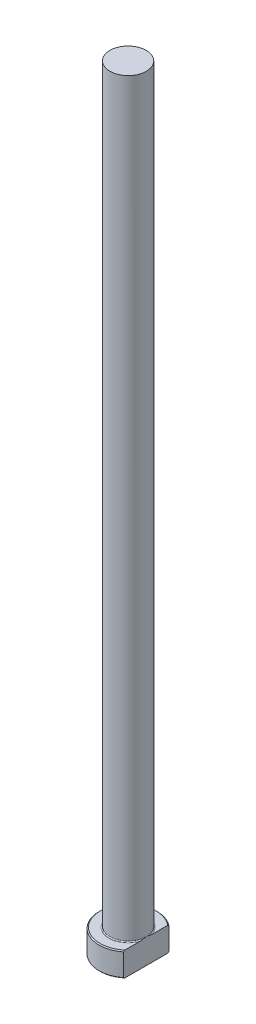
ISO-10303-21;
HEADER;
FILE_DESCRIPTION(('STEP AP214'),'2;1');
FILE_NAME('part.step','',(''),(''),'','','');
FILE_SCHEMA(('AUTOMOTIVE_DESIGN { 1 0 10303 214 1 1 1 1 }'));
ENDSEC;
DATA;
#1=APPLICATION_CONTEXT('core data for automotive mechanical design processes');
#2=APPLICATION_PROTOCOL_DEFINITION('international standard','automotive_design',2000,#1);
#3=PRODUCT_CONTEXT('',#1,'mechanical');
#4=PRODUCT('Part','Part','',(#3));
#5=PRODUCT_RELATED_PRODUCT_CATEGORY('part','',(#4));
#6=PRODUCT_DEFINITION_FORMATION('','',#4);
#7=PRODUCT_DEFINITION_CONTEXT('part definition',#1,'design');
#8=PRODUCT_DEFINITION('design','',#6,#7);
#9=PRODUCT_DEFINITION_SHAPE('','',#8);
#10=(LENGTH_UNIT() NAMED_UNIT(*) SI_UNIT(.MILLI.,.METRE.));
#11=(NAMED_UNIT(*) PLANE_ANGLE_UNIT() SI_UNIT($,.RADIAN.));
#12=(NAMED_UNIT(*) SI_UNIT($,.STERADIAN.) SOLID_ANGLE_UNIT());
#13=UNCERTAINTY_MEASURE_WITH_UNIT(LENGTH_MEASURE(1.E-05),#10,'distance_accuracy_value','');
#14=(GEOMETRIC_REPRESENTATION_CONTEXT(3) GLOBAL_UNCERTAINTY_ASSIGNED_CONTEXT((#13)) GLOBAL_UNIT_ASSIGNED_CONTEXT((#10,
#11,#12)) REPRESENTATION_CONTEXT('',''));
#15=CARTESIAN_POINT('',(0.,0.,0.));
#16=DIRECTION('',(0.,0.,1.));
#17=DIRECTION('',(1.,0.,0.));
#18=AXIS2_PLACEMENT_3D('',#15,#16,#17);
#19=CARTESIAN_POINT('',(0.,0.,0.));
#20=DIRECTION('',(0.,-1.,0.));
#21=DIRECTION('',(0.,0.,-1.));
#22=AXIS2_PLACEMENT_3D('',#19,#20,#21);
#23=PLANE('',#22);
#24=CARTESIAN_POINT('',(0.,0.,0.));
#25=DIRECTION('',(0.,-1.,0.));
#26=DIRECTION('',(0.,0.,-1.));
#27=AXIS2_PLACEMENT_3D('',#24,#25,#26);
#28=CIRCLE('',#27,5.79999999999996);
#29=CARTESIAN_POINT('',(3.74999999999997,0.,4.42464687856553));
#30=VERTEX_POINT('',#29);
#31=CARTESIAN_POINT('',(3.74999999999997,0.,-4.42464687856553));
#32=VERTEX_POINT('',#31);
#33=EDGE_CURVE('E98',#30,#32,#28,.T.);
#34=ORIENTED_EDGE('',*,*,#33,.T.);
#35=DIRECTION('',(0.,0.,1.));
#36=VECTOR('',#35,1.);
#37=CARTESIAN_POINT('',(3.74999999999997,0.,-4.68374849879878));
#38=LINE('',#37,#36);
#39=EDGE_CURVE('E83',#32,#30,#38,.T.);
#40=ORIENTED_EDGE('',*,*,#39,.T.);
#41=EDGE_LOOP('',(#34,#40));
#42=FACE_BOUND('',#41,.T.);
#43=ADVANCED_FACE('F32',(#42),#23,.T.);
#44=CARTESIAN_POINT('',(0.,259.958771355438,0.));
#45=DIRECTION('',(0.,1.,0.));
#46=DIRECTION('',(0.,0.,1.));
#47=AXIS2_PLACEMENT_3D('',#44,#45,#46);
#48=CYLINDRICAL_SURFACE('',#47,5.99999999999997);
#49=CARTESIAN_POINT('',(0.,4.79999999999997,0.));
#50=DIRECTION('',(0.,1.,0.));
#51=DIRECTION('',(0.,0.,1.));
#52=AXIS2_PLACEMENT_3D('',#49,#50,#51);
#53=CIRCLE('',#52,5.99999999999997);
#54=CARTESIAN_POINT('',(3.74999999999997,4.79999999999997,4.68374849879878));
#55=VERTEX_POINT('',#54);
#56=CARTESIAN_POINT('',(3.74999999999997,4.79999999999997,-4.68374849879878));
#57=VERTEX_POINT('',#56);
#58=EDGE_CURVE('E104',#55,#57,#53,.F.);
#59=ORIENTED_EDGE('',*,*,#58,.T.);
#60=DIRECTION('',(0.,-1.,0.));
#61=VECTOR('',#60,1.);
#62=CARTESIAN_POINT('',(3.74999999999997,160.,-4.68374849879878));
#63=LINE('',#62,#61);
#64=CARTESIAN_POINT('',(3.74999999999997,0.199999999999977,-4.68374849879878));
#65=VERTEX_POINT('',#64);
#66=EDGE_CURVE('E183',#57,#65,#63,.T.);
#67=ORIENTED_EDGE('',*,*,#66,.T.);
#68=CARTESIAN_POINT('',(0.,0.199999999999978,0.));
#69=DIRECTION('',(0.,-1.,0.));
#70=DIRECTION('',(0.,0.,-1.));
#71=AXIS2_PLACEMENT_3D('',#68,#69,#70);
#72=CIRCLE('',#71,5.99999999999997);
#73=CARTESIAN_POINT('',(3.74999999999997,0.199999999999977,4.68374849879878));
#74=VERTEX_POINT('',#73);
#75=EDGE_CURVE('E100',#65,#74,#72,.F.);
#76=ORIENTED_EDGE('',*,*,#75,.T.);
#77=DIRECTION('',(0.,-1.,0.));
#78=VECTOR('',#77,1.);
#79=CARTESIAN_POINT('',(3.74999999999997,160.,4.68374849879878));
#80=LINE('',#79,#78);
#81=EDGE_CURVE('E93',#55,#74,#80,.T.);
#82=ORIENTED_EDGE('',*,*,#81,.F.);
#83=EDGE_LOOP('',(#59,#67,#76,#82));
#84=FACE_BOUND('',#83,.T.);
#85=ADVANCED_FACE('F158',(#84),#48,.T.);
#86=CARTESIAN_POINT('',(-5.99999999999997,5.,0.));
#87=DIRECTION('',(0.,1.,0.));
#88=DIRECTION('',(0.,0.,1.));
#89=AXIS2_PLACEMENT_3D('',#86,#87,#88);
#90=PLANE('',#89);
#91=CARTESIAN_POINT('',(0.,5.,0.));
#92=DIRECTION('',(0.,1.,0.));
#93=DIRECTION('',(0.,0.,1.));
#94=AXIS2_PLACEMENT_3D('',#91,#92,#93);
#95=CIRCLE('',#94,5.79999999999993);
#96=CARTESIAN_POINT('',(3.74999999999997,5.,-4.42464687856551));
#97=VERTEX_POINT('',#96);
#98=CARTESIAN_POINT('',(3.74999999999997,5.,4.42464687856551));
#99=VERTEX_POINT('',#98);
#100=EDGE_CURVE('E178',#97,#99,#95,.T.);
#101=ORIENTED_EDGE('',*,*,#100,.T.);
#102=DIRECTION('',(0.,0.,-1.));
#103=VECTOR('',#102,1.);
#104=CARTESIAN_POINT('',(3.74999999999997,5.,0.));
#105=LINE('',#104,#103);
#106=CARTESIAN_POINT('',(3.74999999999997,4.99999999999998,1.24096736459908));
#107=VERTEX_POINT('',#106);
#108=EDGE_CURVE('E57',#99,#107,#105,.T.);
#109=ORIENTED_EDGE('',*,*,#108,.T.);
#110=CARTESIAN_POINT('',(0.,5.,0.));
#111=DIRECTION('',(0.,1.,0.));
#112=DIRECTION('',(0.,0.,1.));
#113=AXIS2_PLACEMENT_3D('',#110,#111,#112);
#114=CIRCLE('',#113,3.94999999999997);
#115=CARTESIAN_POINT('',(3.74999999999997,4.99999999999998,-1.24096736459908));
#116=VERTEX_POINT('',#115);
#117=EDGE_CURVE('E107',#107,#116,#114,.F.);
#118=ORIENTED_EDGE('',*,*,#117,.T.);
#119=EDGE_CURVE('E136',#116,#97,#105,.T.);
#120=ORIENTED_EDGE('',*,*,#119,.T.);
#121=EDGE_LOOP('',(#101,#109,#118,#120));
#122=FACE_BOUND('',#121,.T.);
#123=ADVANCED_FACE('F147',(#122),#90,.T.);
#124=CARTESIAN_POINT('',(0.,5.,0.));
#125=DIRECTION('',(0.,-1.,0.));
#126=DIRECTION('',(0.,0.,-1.));
#127=AXIS2_PLACEMENT_3D('',#124,#125,#126);
#128=CONICAL_SURFACE('',#127,5.79999999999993,0.785398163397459);
#129=ORIENTED_EDGE('',*,*,#58,.F.);
#130=CARTESIAN_POINT('',(3.74999999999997,-0.166791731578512,10.3057275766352));
#131=CARTESIAN_POINT('',(3.74999999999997,-0.0147319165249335,10.1439111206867));
#132=CARTESIAN_POINT('',(3.74999999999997,0.137108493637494,9.98188859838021));
#133=CARTESIAN_POINT('',(3.74999999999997,0.440278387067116,9.65736450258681));
#134=CARTESIAN_POINT('',(3.74999999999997,0.591607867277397,9.49486292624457));
#135=CARTESIAN_POINT('',(3.74999999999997,1.04492777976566,9.00631715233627));
#136=CARTESIAN_POINT('',(3.74999999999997,1.34603930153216,8.67945539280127));
#137=CARTESIAN_POINT('',(3.74999999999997,1.95254712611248,8.01460794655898));
#138=CARTESIAN_POINT('',(3.74999999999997,2.25786252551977,7.67654836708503));
#139=CARTESIAN_POINT('',(3.74999999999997,2.8635361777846,6.99636206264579));
#140=CARTESIAN_POINT('',(3.74999999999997,3.16389732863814,6.65423793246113));
#141=CARTESIAN_POINT('',(3.74999999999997,3.60894976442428,6.13647931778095));
#142=CARTESIAN_POINT('',(3.74999999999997,3.75634976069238,5.96317466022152));
#143=CARTESIAN_POINT('',(3.74999999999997,4.04886653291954,5.61465145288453));
#144=CARTESIAN_POINT('',(3.74999999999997,4.19398335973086,5.43943294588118));
#145=CARTESIAN_POINT('',(3.74999999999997,4.48160030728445,5.0862754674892));
#146=CARTESIAN_POINT('',(3.74999999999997,4.62409465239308,4.90833178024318));
#147=CARTESIAN_POINT('',(3.74999999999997,4.90527650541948,4.54947349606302));
#148=CARTESIAN_POINT('',(3.74999999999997,5.04396432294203,4.36855914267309));
#149=CARTESIAN_POINT('',(3.74999999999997,5.31490367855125,4.0047944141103));
#150=CARTESIAN_POINT('',(3.74999999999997,5.44720614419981,3.821982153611));
#151=CARTESIAN_POINT('',(3.74999999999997,5.70510811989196,3.45154087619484));
#152=CARTESIAN_POINT('',(3.74999999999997,5.83070495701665,3.26390998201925));
#153=CARTESIAN_POINT('',(3.74999999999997,6.07201012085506,2.88323040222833));
#154=CARTESIAN_POINT('',(3.74999999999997,6.18775038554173,2.69020213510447));
#155=CARTESIAN_POINT('',(3.74999999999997,6.40563683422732,2.29668805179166));
#156=CARTESIAN_POINT('',(3.74999999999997,6.50779706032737,2.09621021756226));
#157=CARTESIAN_POINT('',(3.74999999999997,6.65161366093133,1.77679443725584));
#158=CARTESIAN_POINT('',(3.74999999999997,6.70007114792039,1.66092791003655));
#159=CARTESIAN_POINT('',(3.74999999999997,6.78940124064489,1.4262484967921));
#160=CARTESIAN_POINT('',(3.74999999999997,6.83027262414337,1.30743513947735));
#161=CARTESIAN_POINT('',(3.74999999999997,6.90263144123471,1.06768570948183));
#162=CARTESIAN_POINT('',(3.74999999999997,6.93417098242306,0.946765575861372));
#163=CARTESIAN_POINT('',(3.74999999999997,6.98660653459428,0.702615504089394));
#164=CARTESIAN_POINT('',(3.74999999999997,7.00750376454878,0.579385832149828));
#165=CARTESIAN_POINT('',(3.74999999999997,7.03759634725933,0.329742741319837));
#166=CARTESIAN_POINT('',(3.74999999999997,7.04662553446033,0.203308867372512));
#167=CARTESIAN_POINT('',(3.74999999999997,7.05180393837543,-0.0498149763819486));
#168=CARTESIAN_POINT('',(3.74999999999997,7.04795437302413,-0.176504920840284));
#169=CARTESIAN_POINT('',(3.74999999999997,7.02762041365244,-0.429279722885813));
#170=CARTESIAN_POINT('',(3.74999999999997,7.01109328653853,-0.555361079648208));
#171=CARTESIAN_POINT('',(3.74999999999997,6.96645264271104,-0.805449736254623));
#172=CARTESIAN_POINT('',(3.74999999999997,6.93833559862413,-0.929456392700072));
#173=CARTESIAN_POINT('',(3.74999999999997,6.86047960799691,-1.21768075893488));
#174=CARTESIAN_POINT('',(3.74999999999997,6.8066171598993,-1.38077734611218));
#175=CARTESIAN_POINT('',(3.74999999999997,6.68470595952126,-1.70153361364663));
#176=CARTESIAN_POINT('',(3.74999999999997,6.61664932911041,-1.85919021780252));
#177=CARTESIAN_POINT('',(3.74999999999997,6.4690236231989,-2.17116554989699));
#178=CARTESIAN_POINT('',(3.74999999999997,6.38933187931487,-2.32542554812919));
#179=CARTESIAN_POINT('',(3.74999999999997,6.26368569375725,-2.55336011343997));
#180=CARTESIAN_POINT('',(3.74999999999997,6.2207912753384,-2.62875319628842));
#181=CARTESIAN_POINT('',(3.74999999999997,6.13321972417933,-2.77849310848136));
#182=CARTESIAN_POINT('',(3.74999999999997,6.08854268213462,-2.85283999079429));
#183=CARTESIAN_POINT('',(3.74999999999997,5.9312975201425,-3.10843214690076));
#184=CARTESIAN_POINT('',(3.74999999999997,5.81483468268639,-3.2872841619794));
#185=CARTESIAN_POINT('',(3.74999999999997,5.57519396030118,-3.64045104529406));
#186=CARTESIAN_POINT('',(3.74999999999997,5.45201411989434,-3.81476457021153));
#187=CARTESIAN_POINT('',(3.74999999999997,5.2005717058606,-4.15993775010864));
#188=CARTESIAN_POINT('',(3.74999999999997,5.07230420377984,-4.33079380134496));
#189=CARTESIAN_POINT('',(3.74999999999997,4.81202699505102,-4.66958927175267));
#190=CARTESIAN_POINT('',(3.74999999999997,4.6800176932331,-4.83752900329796));
#191=CARTESIAN_POINT('',(3.74999999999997,4.4125358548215,-5.17177751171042));
#192=CARTESIAN_POINT('',(3.74999999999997,4.27705112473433,-5.33807650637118));
#193=CARTESIAN_POINT('',(3.74999999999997,4.00376881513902,-5.66876488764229));
#194=CARTESIAN_POINT('',(3.74999999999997,3.8659711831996,-5.83315423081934));
#195=CARTESIAN_POINT('',(3.74999999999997,3.44998502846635,-6.32380284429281));
#196=CARTESIAN_POINT('',(3.74999999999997,3.16904977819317,-6.64773216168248));
#197=CARTESIAN_POINT('',(3.74999999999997,2.63560043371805,-7.25347079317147));
#198=CARTESIAN_POINT('',(3.74999999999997,2.3836249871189,-7.53575743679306));
#199=CARTESIAN_POINT('',(3.74999999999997,1.87683481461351,-8.09784913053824));
#200=CARTESIAN_POINT('',(3.74999999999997,1.62201964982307,-8.37765378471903));
#201=CARTESIAN_POINT('',(3.74999999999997,1.11240843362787,-8.93303089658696));
#202=CARTESIAN_POINT('',(3.74999999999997,0.857629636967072,-9.20861921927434));
#203=CARTESIAN_POINT('',(3.74999999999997,0.346500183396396,-9.75823398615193));
#204=CARTESIAN_POINT('',(3.74999999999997,0.0901498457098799,-10.0322607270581));
#205=CARTESIAN_POINT('',(3.74999999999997,-0.166791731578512,-10.3057275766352));
#206=B_SPLINE_CURVE_WITH_KNOTS('',3,(#130,#131,#132,#133,#134,#135,#136,#137,#138,#139,#140,
#141,#142,#143,#144,#145,#146,#147,#148,#149,#150,#151,#152,#153,#154,#155,#156,#157,#158,#159,
#160,#161,#162,#163,#164,#165,#166,#167,#168,#169,#170,#171,#172,#173,#174,#175,#176,#177,#178,
#179,#180,#181,#182,#183,#184,#185,#186,#187,#188,#189,#190,#191,#192,#193,#194,#195,#196,#197,
#198,#199,#200,#201,#202,#203,#204,#205),.UNSPECIFIED.,.F.,.F.,(4,2,2,2,2,2,2,2,2,2,2,2,2,2,2,2,
2,2,2,2,2,2,2,2,2,2,2,2,2,2,2,2,2,2,2,2,2,4),(0.,0.666153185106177,1.33231034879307,
2.66554544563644,4.03209014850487,5.39780491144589,6.0803232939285,6.76282645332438,
7.44668645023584,8.13049065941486,8.80737551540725,9.48452819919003,10.1593958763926,
10.8335602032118,11.210125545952,11.586751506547,11.9612329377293,12.3356714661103,
12.7152985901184,13.0948898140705,13.4757662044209,13.8567585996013,14.3711324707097,
14.8857925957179,15.406333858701,15.6665395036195,15.9267319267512,16.5667748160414,
17.207005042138,17.8478713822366,18.4886686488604,19.1321508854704,19.7756477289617,
21.0619101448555,22.1970548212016,23.3323774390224,24.4583149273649,25.5840308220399),.UNSPECIFIED.);
#207=EDGE_CURVE('E135',#55,#99,#206,.T.);
#208=ORIENTED_EDGE('',*,*,#207,.T.);
#209=ORIENTED_EDGE('',*,*,#100,.F.);
#210=EDGE_CURVE('E127',#97,#57,#206,.T.);
#211=ORIENTED_EDGE('',*,*,#210,.T.);
#212=EDGE_LOOP('',(#129,#208,#209,#211));
#213=FACE_BOUND('',#212,.T.);
#214=ADVANCED_FACE('F143',(#213),#128,.T.);
#215=CARTESIAN_POINT('',(0.,0.199999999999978,0.));
#216=DIRECTION('',(0.,1.,0.));
#217=DIRECTION('',(0.,0.,1.));
#218=AXIS2_PLACEMENT_3D('',#215,#216,#217);
#219=CONICAL_SURFACE('',#218,5.99999999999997,0.785398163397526);
#220=ORIENTED_EDGE('',*,*,#75,.F.);
#221=CARTESIAN_POINT('',(3.74999999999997,5.1667917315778,-10.3057275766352));
#222=CARTESIAN_POINT('',(3.74999999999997,5.01473191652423,-10.1439111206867));
#223=CARTESIAN_POINT('',(3.74999999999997,4.86289150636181,-9.98188859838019));
#224=CARTESIAN_POINT('',(3.74999999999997,4.55972161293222,-9.65736450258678));
#225=CARTESIAN_POINT('',(3.74999999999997,4.40839213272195,-9.49486292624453));
#226=CARTESIAN_POINT('',(3.74999999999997,3.95507222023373,-9.00631715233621));
#227=CARTESIAN_POINT('',(3.74999999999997,3.65396069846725,-8.67945539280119));
#228=CARTESIAN_POINT('',(3.74999999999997,3.04745287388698,-8.01460794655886));
#229=CARTESIAN_POINT('',(3.74999999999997,2.74213747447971,-7.67654836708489));
#230=CARTESIAN_POINT('',(3.74999999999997,2.13646382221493,-6.99636206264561));
#231=CARTESIAN_POINT('',(3.74999999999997,1.83610267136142,-6.65423793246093));
#232=CARTESIAN_POINT('',(3.74999999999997,1.39105023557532,-6.13647931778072));
#233=CARTESIAN_POINT('',(3.74999999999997,1.24365023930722,-5.96317466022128));
#234=CARTESIAN_POINT('',(3.74999999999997,0.951133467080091,-5.61465145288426));
#235=CARTESIAN_POINT('',(3.74999999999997,0.806016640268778,-5.4394329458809));
#236=CARTESIAN_POINT('',(3.74999999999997,0.518399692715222,-5.0862754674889));
#237=CARTESIAN_POINT('',(3.74999999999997,0.375905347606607,-4.90833178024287));
#238=CARTESIAN_POINT('',(3.74999999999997,0.0947234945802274,-4.54947349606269));
#239=CARTESIAN_POINT('',(3.74999999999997,-0.0439643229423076,-4.36855914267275));
#240=CARTESIAN_POINT('',(3.74999999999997,-0.314903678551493,-4.00479441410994));
#241=CARTESIAN_POINT('',(3.74999999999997,-0.447206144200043,-3.82198215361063));
#242=CARTESIAN_POINT('',(3.74999999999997,-0.705108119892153,-3.45154087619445));
#243=CARTESIAN_POINT('',(3.74999999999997,-0.830704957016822,-3.26390998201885));
#244=CARTESIAN_POINT('',(3.74999999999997,-1.0720101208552,-2.88323040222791));
#245=CARTESIAN_POINT('',(3.74999999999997,-1.18775038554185,-2.69020213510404));
#246=CARTESIAN_POINT('',(3.74999999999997,-1.40563683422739,-2.29668805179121));
#247=CARTESIAN_POINT('',(3.74999999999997,-1.50779706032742,-2.0962102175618));
#248=CARTESIAN_POINT('',(3.74999999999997,-1.65161366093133,-1.77679443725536));
#249=CARTESIAN_POINT('',(3.74999999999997,-1.70007114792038,-1.66092791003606));
#250=CARTESIAN_POINT('',(3.74999999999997,-1.78940124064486,-1.42624849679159));
#251=CARTESIAN_POINT('',(3.74999999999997,-1.83027262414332,-1.30743513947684));
#252=CARTESIAN_POINT('',(3.74999999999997,-1.90263144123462,-1.06768570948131));
#253=CARTESIAN_POINT('',(3.74999999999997,-1.93417098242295,-0.94676557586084));
#254=CARTESIAN_POINT('',(3.74999999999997,-1.98660653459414,-0.702615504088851));
#255=CARTESIAN_POINT('',(3.74999999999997,-2.00750376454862,-0.579385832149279));
#256=CARTESIAN_POINT('',(3.74999999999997,-2.03759634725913,-0.329742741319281));
#257=CARTESIAN_POINT('',(3.74999999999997,-2.04662553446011,-0.203308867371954));
#258=CARTESIAN_POINT('',(3.74999999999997,-2.05180393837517,0.049814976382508));
#259=CARTESIAN_POINT('',(3.74999999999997,-2.04795437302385,0.176504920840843));
#260=CARTESIAN_POINT('',(3.74999999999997,-2.02762041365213,0.42927972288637));
#261=CARTESIAN_POINT('',(3.74999999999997,-2.0110932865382,0.555361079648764));
#262=CARTESIAN_POINT('',(3.74999999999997,-1.96645264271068,0.805449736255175));
#263=CARTESIAN_POINT('',(3.74999999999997,-1.93833559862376,0.929456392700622));
#264=CARTESIAN_POINT('',(3.74999999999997,-1.8604796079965,1.21768075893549));
#265=CARTESIAN_POINT('',(3.74999999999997,-1.80661715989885,1.38077734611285));
#266=CARTESIAN_POINT('',(3.74999999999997,-1.68470595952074,1.70153361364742));
#267=CARTESIAN_POINT('',(3.74999999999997,-1.61664932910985,1.85919021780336));
#268=CARTESIAN_POINT('',(3.74999999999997,-1.46902362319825,2.17116554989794));
#269=CARTESIAN_POINT('',(3.74999999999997,-1.38933187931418,2.32542554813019));
#270=CARTESIAN_POINT('',(3.74999999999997,-1.26368569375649,2.55336011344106));
#271=CARTESIAN_POINT('',(3.74999999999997,-1.22079127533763,2.62875319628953));
#272=CARTESIAN_POINT('',(3.74999999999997,-1.13321972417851,2.77849310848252));
#273=CARTESIAN_POINT('',(3.74999999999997,-1.08854268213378,2.85283999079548));
#274=CARTESIAN_POINT('',(3.74999999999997,-0.931297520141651,3.10843214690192));
#275=CARTESIAN_POINT('',(3.74999999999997,-0.81483468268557,3.28728416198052));
#276=CARTESIAN_POINT('',(3.74999999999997,-0.575193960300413,3.64045104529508));
#277=CARTESIAN_POINT('',(3.74999999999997,-0.452014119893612,3.81476457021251));
#278=CARTESIAN_POINT('',(3.74999999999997,-0.200571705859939,4.15993775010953));
#279=CARTESIAN_POINT('',(3.74999999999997,-0.0723042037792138,4.3307938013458));
#280=CARTESIAN_POINT('',(3.74999999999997,0.187973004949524,4.66958927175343));
#281=CARTESIAN_POINT('',(3.74999999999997,0.319982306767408,4.83752900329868));
#282=CARTESIAN_POINT('',(3.74999999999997,0.587464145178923,5.17177751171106));
#283=CARTESIAN_POINT('',(3.74999999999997,0.722948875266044,5.33807650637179));
#284=CARTESIAN_POINT('',(3.74999999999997,0.996231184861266,5.66876488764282));
#285=CARTESIAN_POINT('',(3.74999999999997,1.13402881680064,5.83315423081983));
#286=CARTESIAN_POINT('',(3.74999999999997,1.55001497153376,6.32380284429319));
#287=CARTESIAN_POINT('',(3.74999999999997,1.83095022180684,6.6477321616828));
#288=CARTESIAN_POINT('',(3.74999999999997,2.36439956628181,7.2534707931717));
#289=CARTESIAN_POINT('',(3.74999999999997,2.61637501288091,7.53575743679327));
#290=CARTESIAN_POINT('',(3.74999999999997,3.12316518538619,8.0978491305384));
#291=CARTESIAN_POINT('',(3.74999999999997,3.37798035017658,8.37765378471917));
#292=CARTESIAN_POINT('',(3.74999999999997,3.88759156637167,8.93303089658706));
#293=CARTESIAN_POINT('',(3.74999999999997,4.14237036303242,9.20861921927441));
#294=CARTESIAN_POINT('',(3.74999999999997,4.65349981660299,9.75823398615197));
#295=CARTESIAN_POINT('',(3.74999999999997,4.90985015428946,10.0322607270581));
#296=CARTESIAN_POINT('',(3.74999999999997,5.1667917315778,10.3057275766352));
#297=B_SPLINE_CURVE_WITH_KNOTS('',3,(#221,#222,#223,#224,#225,#226,#227,#228,#229,#230,#231,
#232,#233,#234,#235,#236,#237,#238,#239,#240,#241,#242,#243,#244,#245,#246,#247,#248,#249,#250,
#251,#252,#253,#254,#255,#256,#257,#258,#259,#260,#261,#262,#263,#264,#265,#266,#267,#268,#269,
#270,#271,#272,#273,#274,#275,#276,#277,#278,#279,#280,#281,#282,#283,#284,#285,#286,#287,#288,
#289,#290,#291,#292,#293,#294,#295,#296),.UNSPECIFIED.,.F.,.F.,(4,2,2,2,2,2,2,2,2,2,2,2,2,2,2,2,
2,2,2,2,2,2,2,2,2,2,2,2,2,2,2,2,2,2,2,2,2,4),(0.,0.666153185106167,1.33231034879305,
2.66554544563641,4.03209014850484,5.39780491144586,6.08032329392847,6.76282645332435,
7.4466864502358,8.13049065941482,8.80737551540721,9.48452819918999,10.1593958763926,
10.8335602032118,11.210125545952,11.5867515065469,11.9612329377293,12.3356714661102,
12.7152985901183,13.0948898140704,13.4757662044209,13.8567585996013,14.3711324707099,
14.8857925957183,15.4063338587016,15.6665395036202,15.926731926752,16.566774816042,
17.2070050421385,17.8478713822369,18.4886686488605,19.1321508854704,19.7756477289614,
21.061910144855,22.1970548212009,23.3323774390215,24.4583149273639,25.5840308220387),.UNSPECIFIED.);
#298=EDGE_CURVE('E86',#65,#32,#297,.T.);
#299=ORIENTED_EDGE('',*,*,#298,.T.);
#300=ORIENTED_EDGE('',*,*,#33,.F.);
#301=EDGE_CURVE('E89',#30,#74,#297,.T.);
#302=ORIENTED_EDGE('',*,*,#301,.T.);
#303=EDGE_LOOP('',(#220,#299,#300,#302));
#304=FACE_BOUND('',#303,.T.);
#305=ADVANCED_FACE('F97',(#304),#219,.T.);
#306=CARTESIAN_POINT('',(0.,5.19999999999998,0.));
#307=DIRECTION('',(0.,1.,0.));
#308=DIRECTION('',(0.,0.,1.));
#309=AXIS2_PLACEMENT_3D('',#306,#307,#308);
#310=TOROIDAL_SURFACE('',#309,3.94999999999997,0.2);
#311=CARTESIAN_POINT('',(3.74999999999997,5.19999999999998,0.));
#312=CARTESIAN_POINT('',(3.74999999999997,5.20000051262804,-2.87877875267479E-10));
#313=CARTESIAN_POINT('',(3.74999999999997,5.2000010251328,-2.25357307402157E-07));
#314=CARTESIAN_POINT('',(3.74999999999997,5.20000197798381,-8.32474472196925E-07));
#315=CARTESIAN_POINT('',(3.74999999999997,5.20000240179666,-1.23037624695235E-06));
#316=CARTESIAN_POINT('',(3.74999999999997,5.20000329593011,-2.1874363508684E-06));
#317=CARTESIAN_POINT('',(3.74999999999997,5.20000375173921,-2.76211833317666E-06));
#318=CARTESIAN_POINT('',(3.74999999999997,5.20000455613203,-3.94274255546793E-06));
#319=CARTESIAN_POINT('',(3.74999999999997,5.20000490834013,-4.54644341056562E-06));
#320=CARTESIAN_POINT('',(3.74999999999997,5.20000624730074,-6.92466681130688E-06));
#321=CARTESIAN_POINT('',(3.74999999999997,5.20000716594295,-8.74076191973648E-06));
#322=CARTESIAN_POINT('',(3.74999999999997,5.20000864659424,-1.2305250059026E-05));
#323=CARTESIAN_POINT('',(3.74999999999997,5.20000923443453,-1.4043310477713E-05));
#324=CARTESIAN_POINT('',(3.74999999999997,5.20001175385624,-2.15092611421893E-05));
#325=CARTESIAN_POINT('',(3.74999999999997,5.20001367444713,-2.72432101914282E-05));
#326=CARTESIAN_POINT('',(3.74999999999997,5.20001644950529,-3.79951292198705E-05));
#327=CARTESIAN_POINT('',(3.74999999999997,5.20001742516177,-4.29814178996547E-05));
#328=CARTESIAN_POINT('',(3.74999999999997,5.20002460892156,-8.03310024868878E-05));
#329=CARTESIAN_POINT('',(3.74999999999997,5.20003015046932,-0.000112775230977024));
#330=CARTESIAN_POINT('',(3.74999999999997,5.20005437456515,-0.000241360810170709));
#331=CARTESIAN_POINT('',(3.74999999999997,5.20007738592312,-0.000336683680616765));
#332=CARTESIAN_POINT('',(3.74999999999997,5.2001672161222,-0.000714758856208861));
#333=CARTESIAN_POINT('',(3.74999999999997,5.20023131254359,-0.000997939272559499));
#334=CARTESIAN_POINT('',(3.74999999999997,5.20048834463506,-0.00212553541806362));
#335=CARTESIAN_POINT('',(3.74999999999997,5.20068473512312,-0.00296938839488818));
#336=CARTESIAN_POINT('',(3.74999999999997,5.20150889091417,-0.00651948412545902));
#337=CARTESIAN_POINT('',(3.74999999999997,5.20213227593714,-0.00922644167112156));
#338=CARTESIAN_POINT('',(3.74999999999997,5.21093696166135,-0.047449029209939));
#339=CARTESIAN_POINT('',(3.74999999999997,5.21914648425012,-0.0829604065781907));
#340=CARTESIAN_POINT('',(3.74999999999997,5.23634325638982,-0.157927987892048));
#341=CARTESIAN_POINT('',(3.74999999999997,5.24531641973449,-0.197387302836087));
#342=CARTESIAN_POINT('',(3.74999999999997,5.26041433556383,-0.264774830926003));
#343=CARTESIAN_POINT('',(3.74999999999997,5.26660221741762,-0.292688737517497));
#344=CARTESIAN_POINT('',(3.74999999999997,5.27863779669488,-0.347814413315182));
#345=CARTESIAN_POINT('',(3.74999999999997,5.28449016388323,-0.375025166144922));
#346=CARTESIAN_POINT('',(3.74999999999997,5.30189789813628,-0.457537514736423));
#347=CARTESIAN_POINT('',(3.74999999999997,5.31311990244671,-0.512910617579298));
#348=CARTESIAN_POINT('',(3.74999999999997,5.33435371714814,-0.624416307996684));
#349=CARTESIAN_POINT('',(3.74999999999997,5.34435351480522,-0.68055120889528));
#350=CARTESIAN_POINT('',(3.74999999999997,5.3633402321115,-0.798309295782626));
#351=CARTESIAN_POINT('',(3.74999999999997,5.37214919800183,-0.859962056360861));
#352=CARTESIAN_POINT('',(3.74999999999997,5.38667037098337,-0.983470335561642));
#353=CARTESIAN_POINT('',(3.74999999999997,5.39239104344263,-1.04532482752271));
#354=CARTESIAN_POINT('',(3.74999999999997,5.39944323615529,-1.16735704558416));
#355=CARTESIAN_POINT('',(3.74999999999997,5.40090877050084,-1.22752541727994));
#356=CARTESIAN_POINT('',(3.74999999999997,5.39872274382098,-1.31720401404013));
#357=CARTESIAN_POINT('',(3.74999999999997,5.39729193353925,-1.34676575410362));
#358=CARTESIAN_POINT('',(3.74999999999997,5.39265012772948,-1.40574048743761));
#359=CARTESIAN_POINT('',(3.74999999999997,5.38944021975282,-1.43515356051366));
#360=CARTESIAN_POINT('',(3.74999999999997,5.38068094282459,-1.49396538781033));
#361=CARTESIAN_POINT('',(3.74999999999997,5.37510711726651,-1.52336068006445));
#362=CARTESIAN_POINT('',(3.74999999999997,5.36076919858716,-1.58137061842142));
#363=CARTESIAN_POINT('',(3.74999999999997,5.35200919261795,-1.60998621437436));
#364=CARTESIAN_POINT('',(3.74999999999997,5.33238965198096,-1.65861686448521));
#365=CARTESIAN_POINT('',(3.74999999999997,5.32257316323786,-1.67901898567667));
#366=CARTESIAN_POINT('',(3.74999999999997,5.30467241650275,-1.70783277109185));
#367=CARTESIAN_POINT('',(3.74999999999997,5.29812945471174,-1.71718739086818));
#368=CARTESIAN_POINT('',(3.74999999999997,5.2837001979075,-1.73480018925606));
#369=CARTESIAN_POINT('',(3.74999999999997,5.27581911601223,-1.74306240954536));
#370=CARTESIAN_POINT('',(3.74999999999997,5.26261463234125,-1.75418373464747));
#371=CARTESIAN_POINT('',(3.74999999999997,5.25787681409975,-1.75773399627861));
#372=CARTESIAN_POINT('',(3.74999999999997,5.24794673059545,-1.76414289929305));
#373=CARTESIAN_POINT('',(3.74999999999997,5.24275459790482,-1.76700174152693));
#374=CARTESIAN_POINT('',(3.74999999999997,5.23188845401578,-1.77184194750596));
#375=CARTESIAN_POINT('',(3.74999999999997,5.22620925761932,-1.77381196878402));
#376=CARTESIAN_POINT('',(3.74999999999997,5.21457526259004,-1.77659633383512));
#377=CARTESIAN_POINT('',(3.74999999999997,5.20862098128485,-1.77741276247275));
#378=CARTESIAN_POINT('',(3.74999999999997,5.19743537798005,-1.77775957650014));
#379=CARTESIAN_POINT('',(3.74999999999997,5.19220837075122,-1.77744024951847));
#380=CARTESIAN_POINT('',(3.74999999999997,5.18189414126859,-1.7758778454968));
#381=CARTESIAN_POINT('',(3.74999999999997,5.17680701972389,-1.77463412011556));
#382=CARTESIAN_POINT('',(3.74999999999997,5.16595570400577,-1.7710259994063));
#383=CARTESIAN_POINT('',(3.74999999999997,5.16024847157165,-1.76849257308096));
#384=CARTESIAN_POINT('',(3.74999999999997,5.14931958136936,-1.76253978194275));
#385=CARTESIAN_POINT('',(3.74999999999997,5.14409879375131,-1.75911886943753));
#386=CARTESIAN_POINT('',(3.74999999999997,5.13137207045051,-1.74952862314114));
#387=CARTESIAN_POINT('',(3.74999999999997,5.12422146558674,-1.74289229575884));
#388=CARTESIAN_POINT('',(3.74999999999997,5.11098063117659,-1.72864029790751));
#389=CARTESIAN_POINT('',(3.74999999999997,5.1048935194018,-1.72102185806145));
#390=CARTESIAN_POINT('',(3.74999999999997,5.08827617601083,-1.69771313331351));
#391=CARTESIAN_POINT('',(3.74999999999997,5.07895354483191,-1.68117193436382));
#392=CARTESIAN_POINT('',(3.74999999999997,5.06261247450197,-1.64704828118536));
#393=CARTESIAN_POINT('',(3.74999999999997,5.05559655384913,-1.62946471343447));
#394=CARTESIAN_POINT('',(3.74999999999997,5.04053076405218,-1.58583200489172));
#395=CARTESIAN_POINT('',(3.74999999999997,5.03339137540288,-1.55947193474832));
#396=CARTESIAN_POINT('',(3.74999999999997,5.02157296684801,-1.50618793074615));
#397=CARTESIAN_POINT('',(3.74999999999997,5.01689927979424,-1.47926290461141));
#398=CARTESIAN_POINT('',(3.74999999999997,5.00936793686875,-1.42466530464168));
#399=CARTESIAN_POINT('',(3.74999999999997,5.00654501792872,-1.39698806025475));
#400=CARTESIAN_POINT('',(3.74999999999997,5.00244752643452,-1.34156614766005));
#401=CARTESIAN_POINT('',(3.74999999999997,5.00117081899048,-1.31382162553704));
#402=CARTESIAN_POINT('',(3.74999999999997,4.99934872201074,-1.2362264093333));
#403=CARTESIAN_POINT('',(3.74999999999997,5.00019255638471,-1.18634383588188));
#404=CARTESIAN_POINT('',(3.74999999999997,5.00481837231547,-1.08670490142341));
#405=CARTESIAN_POINT('',(3.74999999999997,5.00860250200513,-1.03694865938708));
#406=CARTESIAN_POINT('',(3.74999999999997,5.02331363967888,-0.887521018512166));
#407=CARTESIAN_POINT('',(3.74999999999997,5.03759480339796,-0.788187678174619));
#408=CARTESIAN_POINT('',(3.74999999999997,5.06960041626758,-0.600482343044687));
#409=CARTESIAN_POINT('',(3.74999999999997,5.08683046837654,-0.512017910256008));
#410=CARTESIAN_POINT('',(3.74999999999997,5.12342991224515,-0.336669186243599));
#411=CARTESIAN_POINT('',(3.74999999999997,5.14277046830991,-0.249778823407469));
#412=CARTESIAN_POINT('',(3.74999999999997,5.16735885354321,-0.141807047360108));
#413=CARTESIAN_POINT('',(3.74999999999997,5.17220802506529,-0.120630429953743));
#414=CARTESIAN_POINT('',(3.74999999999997,5.18059064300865,-0.0841346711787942));
#415=CARTESIAN_POINT('',(3.74999999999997,5.1841173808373,-0.0688139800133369));
#416=CARTESIAN_POINT('',(3.74999999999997,5.1908487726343,-0.0396407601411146));
#417=CARTESIAN_POINT('',(3.74999999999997,5.19405197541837,-0.0257879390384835));
#418=CARTESIAN_POINT('',(3.74999999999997,5.1978642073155,-0.00924234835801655));
#419=CARTESIAN_POINT('',(3.74999999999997,5.19848382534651,-0.00655125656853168));
#420=CARTESIAN_POINT('',(3.74999999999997,5.19930710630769,-0.00300474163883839));
#421=CARTESIAN_POINT('',(3.74999999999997,5.19950636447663,-0.00214860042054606));
#422=CARTESIAN_POINT('',(3.74999999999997,5.19976688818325,-0.00100569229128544));
#423=CARTESIAN_POINT('',(3.74999999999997,5.19983166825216,-0.000719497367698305));
#424=CARTESIAN_POINT('',(3.74999999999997,5.19992231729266,-0.000337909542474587));
#425=CARTESIAN_POINT('',(3.74999999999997,5.19994544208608,-0.000242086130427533));
#426=CARTESIAN_POINT('',(3.74999999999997,5.1999697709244,-0.00011292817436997));
#427=CARTESIAN_POINT('',(3.74999999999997,5.19997532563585,-8.04160223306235E-05));
#428=CARTESIAN_POINT('',(3.74999999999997,5.19998253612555,-4.29967852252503E-05));
#429=CARTESIAN_POINT('',(3.74999999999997,5.19998351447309,-3.80069370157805E-05));
#430=CARTESIAN_POINT('',(3.74999999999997,5.19998629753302,-2.72475249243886E-05));
#431=CARTESIAN_POINT('',(3.74999999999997,5.19998822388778,-2.15098292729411E-05));
#432=CARTESIAN_POINT('',(3.74999999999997,5.19999075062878,-1.40399367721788E-05));
#433=CARTESIAN_POINT('',(3.74999999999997,5.19999133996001,-1.23016119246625E-05));
#434=CARTESIAN_POINT('',(3.74999999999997,5.19999282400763,-8.73682092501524E-06));
#435=CARTESIAN_POINT('',(3.74999999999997,5.19999374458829,-6.92072367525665E-06));
#436=CARTESIAN_POINT('',(3.74999999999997,5.19999508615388,-4.54275759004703E-06));
#437=CARTESIAN_POINT('',(3.74999999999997,5.19999543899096,-3.93920665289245E-06));
#438=CARTESIAN_POINT('',(3.74999999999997,5.19999624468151,-2.7589957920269E-06));
#439=CARTESIAN_POINT('',(3.74999999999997,5.19999670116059,-2.18458256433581E-06));
#440=CARTESIAN_POINT('',(3.74999999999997,5.19999759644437,-1.22814421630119E-06));
#441=CARTESIAN_POINT('',(3.74999999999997,5.19999802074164,-8.30569674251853E-07));
#442=CARTESIAN_POINT('',(3.74999999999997,5.19999897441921,-2.24293963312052E-07));
#443=CARTESIAN_POINT('',(3.74999999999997,5.19999948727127,2.87934400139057E-10));
#444=CARTESIAN_POINT('',(3.74999999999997,5.19999999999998,0.));
#445=B_SPLINE_CURVE_WITH_KNOTS('',3,(#311,#312,#313,#314,#315,#316,#317,#318,#319,#320,#321,
#322,#323,#324,#325,#326,#327,#328,#329,#330,#331,#332,#333,#334,#335,#336,#337,#338,#339,#340,
#341,#342,#343,#344,#345,#346,#347,#348,#349,#350,#351,#352,#353,#354,#355,#356,#357,#358,#359,
#360,#361,#362,#363,#364,#365,#366,#367,#368,#369,#370,#371,#372,#373,#374,#375,#376,#377,#378,
#379,#380,#381,#382,#383,#384,#385,#386,#387,#388,#389,#390,#391,#392,#393,#394,#395,#396,#397,
#398,#399,#400,#401,#402,#403,#404,#405,#406,#407,#408,#409,#410,#411,#412,#413,#414,#415,#416,
#417,#418,#419,#420,#421,#422,#423,#424,#425,#426,#427,#428,#429,#430,#431,#432,#433,#434,#435,
#436,#437,#438,#439,#440,#441,#442,#443,#444),.UNSPECIFIED.,.T.,.F.,(4,2,2,2,2,2,2,2,2,2,2,2,2,
2,2,2,2,2,2,2,2,2,2,2,2,2,2,2,2,2,2,2,2,2,2,2,2,2,2,2,2,2,2,2,2,2,2,2,2,2,2,2,2,2,2,2,2,2,2,2,2,
2,2,2,2,2,4),(0.,1.56024700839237E-06,3.31164948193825E-06,5.49717735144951E-06,
7.59327506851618E-06,1.36787180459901E-05,1.91779081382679E-05,3.7292487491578E-05,
5.25176797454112E-05,0.000151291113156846,0.000445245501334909,0.00131651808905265,
0.00391543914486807,0.0122492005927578,0.121590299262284,0.242990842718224,0.328764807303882,
0.412263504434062,0.581748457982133,0.752784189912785,0.939563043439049,1.12582728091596,
1.30615794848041,1.3949070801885,1.48360201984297,1.57323786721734,1.66275913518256,
1.73030791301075,1.76447537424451,1.79851265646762,1.81622926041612,1.83394071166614,
1.85187219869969,1.86977123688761,1.885394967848,1.90102966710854,1.91965920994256,
1.9383214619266,1.9674229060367,1.99660828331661,2.05325108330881,2.10995552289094,
2.19168848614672,2.27359750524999,2.35700291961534,2.44029304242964,2.5898264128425,
2.7394691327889,3.04023923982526,3.31058675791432,3.57761795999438,3.64279234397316,
3.68995668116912,3.73261073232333,3.74089559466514,3.74353236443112,3.74441291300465,
3.74470840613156,3.74480738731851,3.74482262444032,3.74484075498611,3.74484625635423,
3.74485234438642,3.74485444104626,3.74485662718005,3.74485837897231,3.74485993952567),.UNSPECIFIED.);
#446=CARTESIAN_POINT('',(3.74999999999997,5.19999999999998,0.));
#447=VERTEX_POINT('',#446);
#448=EDGE_CURVE('E11',#116,#447,#445,.T.);
#449=ORIENTED_EDGE('',*,*,#448,.F.);
#450=ORIENTED_EDGE('',*,*,#117,.F.);
#451=CARTESIAN_POINT('',(3.74999999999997,5.19999999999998,0.));
#452=CARTESIAN_POINT('',(3.74999999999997,5.19999948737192,2.87877832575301E-10));
#453=CARTESIAN_POINT('',(3.74999999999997,5.19999897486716,2.25357307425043E-07));
#454=CARTESIAN_POINT('',(3.74999999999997,5.19999802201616,8.32474472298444E-07));
#455=CARTESIAN_POINT('',(3.74999999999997,5.1999975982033,1.23037624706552E-06));
#456=CARTESIAN_POINT('',(3.74999999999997,5.19999670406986,2.18743635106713E-06));
#457=CARTESIAN_POINT('',(3.74999999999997,5.19999624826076,2.76211833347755E-06));
#458=CARTESIAN_POINT('',(3.74999999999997,5.19999544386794,3.94274255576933E-06));
#459=CARTESIAN_POINT('',(3.74999999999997,5.19999509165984,4.54644341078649E-06));
#460=CARTESIAN_POINT('',(3.74999999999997,5.19999375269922,6.92466681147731E-06));
#461=CARTESIAN_POINT('',(3.74999999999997,5.19999283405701,8.74076191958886E-06));
#462=CARTESIAN_POINT('',(3.74999999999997,5.19999135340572,1.23052500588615E-05));
#463=CARTESIAN_POINT('',(3.74999999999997,5.19999076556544,1.40433104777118E-05));
#464=CARTESIAN_POINT('',(3.74999999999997,5.19998824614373,2.15092611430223E-05));
#465=CARTESIAN_POINT('',(3.74999999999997,5.19998632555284,2.72432101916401E-05));
#466=CARTESIAN_POINT('',(3.74999999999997,5.19998355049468,3.79951292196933E-05));
#467=CARTESIAN_POINT('',(3.74999999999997,5.1999825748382,4.29814178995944E-05));
#468=CARTESIAN_POINT('',(3.74999999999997,5.1999753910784,8.03310024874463E-05));
#469=CARTESIAN_POINT('',(3.74999999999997,5.19996984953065,0.000112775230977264));
#470=CARTESIAN_POINT('',(3.74999999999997,5.19994562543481,0.00024136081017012));
#471=CARTESIAN_POINT('',(3.74999999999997,5.19992261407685,0.000336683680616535));
#472=CARTESIAN_POINT('',(3.74999999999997,5.19983278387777,0.000714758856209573));
#473=CARTESIAN_POINT('',(3.74999999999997,5.19976868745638,0.00099793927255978));
#474=CARTESIAN_POINT('',(3.74999999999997,5.1995116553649,0.00212553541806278));
#475=CARTESIAN_POINT('',(3.74999999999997,5.19931526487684,0.00296938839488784));
#476=CARTESIAN_POINT('',(3.74999999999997,5.19849110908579,0.0065194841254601));
#477=CARTESIAN_POINT('',(3.74999999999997,5.19786772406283,0.00922644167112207));
#478=CARTESIAN_POINT('',(3.74999999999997,5.18906303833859,0.0474490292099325));
#479=CARTESIAN_POINT('',(3.74999999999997,5.18085351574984,0.0829604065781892));
#480=CARTESIAN_POINT('',(3.74999999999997,5.16365674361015,0.157927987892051));
#481=CARTESIAN_POINT('',(3.74999999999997,5.15468358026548,0.197387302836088));
#482=CARTESIAN_POINT('',(3.74999999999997,5.13958566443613,0.264774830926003));
#483=CARTESIAN_POINT('',(3.74999999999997,5.13339778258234,0.292688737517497));
#484=CARTESIAN_POINT('',(3.74999999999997,5.12136220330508,0.347814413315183));
#485=CARTESIAN_POINT('',(3.74999999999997,5.11550983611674,0.375025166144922));
#486=CARTESIAN_POINT('',(3.74999999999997,5.09810210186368,0.457537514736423));
#487=CARTESIAN_POINT('',(3.74999999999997,5.08688009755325,0.512910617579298));
#488=CARTESIAN_POINT('',(3.74999999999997,5.06564628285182,0.624416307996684));
#489=CARTESIAN_POINT('',(3.74999999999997,5.05564648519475,0.68055120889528));
#490=CARTESIAN_POINT('',(3.74999999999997,5.03665976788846,0.798309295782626));
#491=CARTESIAN_POINT('',(3.74999999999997,5.02785080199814,0.859962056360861));
#492=CARTESIAN_POINT('',(3.74999999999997,5.01332962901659,0.983470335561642));
#493=CARTESIAN_POINT('',(3.74999999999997,5.00760895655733,1.04532482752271));
#494=CARTESIAN_POINT('',(3.74999999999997,5.00055676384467,1.16735704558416));
#495=CARTESIAN_POINT('',(3.74999999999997,4.99909122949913,1.22752541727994));
#496=CARTESIAN_POINT('',(3.74999999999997,5.00127725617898,1.31720401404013));
#497=CARTESIAN_POINT('',(3.74999999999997,5.00270806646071,1.34676575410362));
#498=CARTESIAN_POINT('',(3.74999999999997,5.00734987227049,1.40574048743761));
#499=CARTESIAN_POINT('',(3.74999999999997,5.01055978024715,1.43515356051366));
#500=CARTESIAN_POINT('',(3.74999999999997,5.01931905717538,1.49396538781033));
#501=CARTESIAN_POINT('',(3.74999999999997,5.02489288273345,1.52336068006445));
#502=CARTESIAN_POINT('',(3.74999999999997,5.0392308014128,1.58137061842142));
#503=CARTESIAN_POINT('',(3.74999999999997,5.04799080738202,1.60998621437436));
#504=CARTESIAN_POINT('',(3.74999999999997,5.067610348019,1.65861686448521));
#505=CARTESIAN_POINT('',(3.74999999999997,5.07742683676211,1.67901898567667));
#506=CARTESIAN_POINT('',(3.74999999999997,5.09532758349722,1.70783277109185));
#507=CARTESIAN_POINT('',(3.74999999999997,5.10187054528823,1.71718739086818));
#508=CARTESIAN_POINT('',(3.74999999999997,5.11629980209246,1.73480018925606));
#509=CARTESIAN_POINT('',(3.74999999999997,5.12418088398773,1.74306240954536));
#510=CARTESIAN_POINT('',(3.74999999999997,5.13738536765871,1.75418373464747));
#511=CARTESIAN_POINT('',(3.74999999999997,5.14212318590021,1.75773399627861));
#512=CARTESIAN_POINT('',(3.74999999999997,5.15205326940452,1.76414289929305));
#513=CARTESIAN_POINT('',(3.74999999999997,5.15724540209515,1.76700174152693));
#514=CARTESIAN_POINT('',(3.74999999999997,5.16811154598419,1.77184194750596));
#515=CARTESIAN_POINT('',(3.74999999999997,5.17379074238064,1.77381196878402));
#516=CARTESIAN_POINT('',(3.74999999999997,5.18542473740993,1.77659633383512));
#517=CARTESIAN_POINT('',(3.74999999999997,5.19137901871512,1.77741276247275));
#518=CARTESIAN_POINT('',(3.74999999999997,5.20256462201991,1.77775957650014));
#519=CARTESIAN_POINT('',(3.74999999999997,5.20779162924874,1.77744024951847));
#520=CARTESIAN_POINT('',(3.74999999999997,5.21810585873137,1.7758778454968));
#521=CARTESIAN_POINT('',(3.74999999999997,5.22319298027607,1.77463412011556));
#522=CARTESIAN_POINT('',(3.74999999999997,5.2340442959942,1.7710259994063));
#523=CARTESIAN_POINT('',(3.74999999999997,5.23975152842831,1.76849257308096));
#524=CARTESIAN_POINT('',(3.74999999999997,5.2506804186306,1.76253978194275));
#525=CARTESIAN_POINT('',(3.74999999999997,5.25590120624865,1.75911886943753));
#526=CARTESIAN_POINT('',(3.74999999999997,5.26862792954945,1.74952862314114));
#527=CARTESIAN_POINT('',(3.74999999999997,5.27577853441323,1.74289229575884));
#528=CARTESIAN_POINT('',(3.74999999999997,5.28901936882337,1.72864029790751));
#529=CARTESIAN_POINT('',(3.74999999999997,5.29510648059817,1.72102185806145));
#530=CARTESIAN_POINT('',(3.74999999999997,5.31172382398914,1.69771313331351));
#531=CARTESIAN_POINT('',(3.74999999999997,5.32104645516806,1.68117193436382));
#532=CARTESIAN_POINT('',(3.74999999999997,5.33738752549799,1.64704828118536));
#533=CARTESIAN_POINT('',(3.74999999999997,5.34440344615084,1.62946471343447));
#534=CARTESIAN_POINT('',(3.74999999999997,5.35946923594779,1.58583200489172));
#535=CARTESIAN_POINT('',(3.74999999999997,5.36660862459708,1.55947193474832));
#536=CARTESIAN_POINT('',(3.74999999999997,5.37842703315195,1.50618793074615));
#537=CARTESIAN_POINT('',(3.74999999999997,5.38310072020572,1.47926290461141));
#538=CARTESIAN_POINT('',(3.74999999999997,5.39063206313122,1.42466530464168));
#539=CARTESIAN_POINT('',(3.74999999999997,5.39345498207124,1.39698806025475));
#540=CARTESIAN_POINT('',(3.74999999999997,5.39755247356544,1.34156614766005));
#541=CARTESIAN_POINT('',(3.74999999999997,5.39882918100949,1.31382162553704));
#542=CARTESIAN_POINT('',(3.74999999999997,5.40065127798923,1.2362264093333));
#543=CARTESIAN_POINT('',(3.74999999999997,5.39980744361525,1.18634383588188));
#544=CARTESIAN_POINT('',(3.74999999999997,5.39518162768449,1.08670490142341));
#545=CARTESIAN_POINT('',(3.74999999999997,5.39139749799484,1.03694865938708));
#546=CARTESIAN_POINT('',(3.74999999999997,5.37668636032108,0.887521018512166));
#547=CARTESIAN_POINT('',(3.74999999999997,5.362405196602,0.788187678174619));
#548=CARTESIAN_POINT('',(3.74999999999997,5.33039958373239,0.600482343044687));
#549=CARTESIAN_POINT('',(3.74999999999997,5.31316953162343,0.512017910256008));
#550=CARTESIAN_POINT('',(3.74999999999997,5.27657008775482,0.336669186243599));
#551=CARTESIAN_POINT('',(3.74999999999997,5.25722953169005,0.249778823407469));
#552=CARTESIAN_POINT('',(3.74999999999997,5.23264114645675,0.141807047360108));
#553=CARTESIAN_POINT('',(3.74999999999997,5.22779197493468,0.120630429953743));
#554=CARTESIAN_POINT('',(3.74999999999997,5.21940935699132,0.0841346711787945));
#555=CARTESIAN_POINT('',(3.74999999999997,5.21588261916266,0.0688139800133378));
#556=CARTESIAN_POINT('',(3.74999999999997,5.20915122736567,0.0396407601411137));
#557=CARTESIAN_POINT('',(3.74999999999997,5.20594802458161,0.0257879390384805));
#558=CARTESIAN_POINT('',(3.74999999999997,5.20213579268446,0.00924234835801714));
#559=CARTESIAN_POINT('',(3.74999999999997,5.20151617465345,0.00655125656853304));
#560=CARTESIAN_POINT('',(3.74999999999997,5.20069289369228,0.00300474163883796));
#561=CARTESIAN_POINT('',(3.74999999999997,5.20049363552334,0.00214860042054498));
#562=CARTESIAN_POINT('',(3.74999999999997,5.20023311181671,0.00100569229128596));
#563=CARTESIAN_POINT('',(3.74999999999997,5.2001683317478,0.000719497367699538));
#564=CARTESIAN_POINT('',(3.74999999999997,5.2000776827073,0.000337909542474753));
#565=CARTESIAN_POINT('',(3.74999999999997,5.20005455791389,0.000242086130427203));
#566=CARTESIAN_POINT('',(3.74999999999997,5.20003022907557,0.000112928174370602));
#567=CARTESIAN_POINT('',(3.74999999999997,5.20002467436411,8.04160223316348E-05));
#568=CARTESIAN_POINT('',(3.74999999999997,5.20001746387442,4.29967852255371E-05));
#569=CARTESIAN_POINT('',(3.74999999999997,5.20001648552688,3.80069370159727E-05));
#570=CARTESIAN_POINT('',(3.74999999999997,5.20001370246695,2.72475249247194E-05));
#571=CARTESIAN_POINT('',(3.74999999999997,5.20001177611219,2.15098292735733E-05));
#572=CARTESIAN_POINT('',(3.74999999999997,5.20000924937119,1.40399367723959E-05));
#573=CARTESIAN_POINT('',(3.74999999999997,5.20000866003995,1.23016119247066E-05));
#574=CARTESIAN_POINT('',(3.74999999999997,5.20000717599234,8.73682092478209E-06));
#575=CARTESIAN_POINT('',(3.74999999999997,5.20000625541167,6.92072367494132E-06));
#576=CARTESIAN_POINT('',(3.74999999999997,5.20000491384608,4.54275759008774E-06));
#577=CARTESIAN_POINT('',(3.74999999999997,5.20000456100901,3.93920665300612E-06));
#578=CARTESIAN_POINT('',(3.74999999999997,5.20000375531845,2.75899579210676E-06));
#579=CARTESIAN_POINT('',(3.74999999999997,5.20000329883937,2.18458256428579E-06));
#580=CARTESIAN_POINT('',(3.74999999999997,5.2000024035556,1.22814421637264E-06));
#581=CARTESIAN_POINT('',(3.74999999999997,5.20000197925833,8.30569674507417E-07));
#582=CARTESIAN_POINT('',(3.74999999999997,5.20000102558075,2.24293963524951E-07));
#583=CARTESIAN_POINT('',(3.74999999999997,5.2000005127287,-2.87934357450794E-10));
#584=CARTESIAN_POINT('',(3.74999999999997,5.19999999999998,0.));
#585=B_SPLINE_CURVE_WITH_KNOTS('',3,(#451,#452,#453,#454,#455,#456,#457,#458,#459,#460,#461,
#462,#463,#464,#465,#466,#467,#468,#469,#470,#471,#472,#473,#474,#475,#476,#477,#478,#479,#480,
#481,#482,#483,#484,#485,#486,#487,#488,#489,#490,#491,#492,#493,#494,#495,#496,#497,#498,#499,
#500,#501,#502,#503,#504,#505,#506,#507,#508,#509,#510,#511,#512,#513,#514,#515,#516,#517,#518,
#519,#520,#521,#522,#523,#524,#525,#526,#527,#528,#529,#530,#531,#532,#533,#534,#535,#536,#537,
#538,#539,#540,#541,#542,#543,#544,#545,#546,#547,#548,#549,#550,#551,#552,#553,#554,#555,#556,
#557,#558,#559,#560,#561,#562,#563,#564,#565,#566,#567,#568,#569,#570,#571,#572,#573,#574,#575,
#576,#577,#578,#579,#580,#581,#582,#583,#584),.UNSPECIFIED.,.T.,.F.,(4,2,2,2,2,2,2,2,2,2,2,2,2,
2,2,2,2,2,2,2,2,2,2,2,2,2,2,2,2,2,2,2,2,2,2,2,2,2,2,2,2,2,2,2,2,2,2,2,2,2,2,2,2,2,2,2,2,2,2,2,2,
2,2,2,2,2,4),(0.,1.5602470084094E-06,3.31164948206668E-06,5.49717735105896E-06,
7.59327506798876E-06,1.36787180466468E-05,1.9177908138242E-05,3.72924874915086E-05,
5.25176797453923E-05,0.000151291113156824,0.000445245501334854,0.00131651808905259,
0.00391543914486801,0.0122492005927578,0.121590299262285,0.242990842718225,0.328764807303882,
0.412263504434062,0.581748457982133,0.752784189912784,0.939563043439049,1.12582728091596,
1.30615794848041,1.3949070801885,1.48360201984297,1.57323786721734,1.66275913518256,
1.73030791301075,1.76447537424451,1.79851265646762,1.81622926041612,1.83394071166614,
1.85187219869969,1.86977123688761,1.885394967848,1.90102966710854,1.91965920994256,
1.9383214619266,1.9674229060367,1.99660828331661,2.05325108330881,2.10995552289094,
2.19168848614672,2.27359750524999,2.35700291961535,2.44029304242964,2.5898264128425,
2.7394691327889,3.04023923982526,3.31058675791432,3.57761795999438,3.64279234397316,
3.68995668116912,3.73261073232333,3.74089559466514,3.74353236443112,3.74441291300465,
3.74470840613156,3.74480738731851,3.74482262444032,3.74484075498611,3.74484625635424,
3.74485234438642,3.74485444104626,3.74485662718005,3.74485837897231,3.74485993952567),.UNSPECIFIED.);
#586=EDGE_CURVE('E46',#447,#107,#585,.T.);
#587=ORIENTED_EDGE('',*,*,#586,.F.);
#588=CARTESIAN_POINT('',(0.,5.19999999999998,0.));
#589=DIRECTION('',(0.,1.,0.));
#590=DIRECTION('',(0.,0.,1.));
#591=AXIS2_PLACEMENT_3D('',#588,#589,#590);
#592=CIRCLE('',#591,3.74999999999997);
#593=EDGE_CURVE('E103',#447,#447,#592,.T.);
#594=ORIENTED_EDGE('',*,*,#593,.F.);
#595=EDGE_LOOP('',(#449,#450,#587,#594));
#596=FACE_BOUND('',#595,.T.);
#597=ADVANCED_FACE('F34',(#596),#310,.F.);
#598=CARTESIAN_POINT('',(0.,259.958771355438,0.));
#599=DIRECTION('',(0.,1.,0.));
#600=DIRECTION('',(0.,0.,1.));
#601=AXIS2_PLACEMENT_3D('',#598,#599,#600);
#602=CYLINDRICAL_SURFACE('',#601,3.74999999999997);
#603=ORIENTED_EDGE('',*,*,#593,.T.);
#604=EDGE_LOOP('',(#603));
#605=FACE_BOUND('',#604,.T.);
#606=CARTESIAN_POINT('',(0.,160.,0.));
#607=DIRECTION('',(0.,1.,0.));
#608=DIRECTION('',(0.,0.,1.));
#609=AXIS2_PLACEMENT_3D('',#606,#607,#608);
#610=CIRCLE('',#609,3.74999999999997);
#611=CARTESIAN_POINT('',(0.,160.,3.74999999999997));
#612=VERTEX_POINT('',#611);
#613=EDGE_CURVE('E101',#612,#612,#610,.T.);
#614=ORIENTED_EDGE('',*,*,#613,.F.);
#615=EDGE_LOOP('',(#614));
#616=FACE_BOUND('',#615,.T.);
#617=ADVANCED_FACE('F155',(#605,#616),#602,.T.);
#618=CARTESIAN_POINT('',(-3.74999999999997,160.,0.));
#619=DIRECTION('',(0.,1.,0.));
#620=DIRECTION('',(0.,0.,1.));
#621=AXIS2_PLACEMENT_3D('',#618,#619,#620);
#622=PLANE('',#621);
#623=ORIENTED_EDGE('',*,*,#613,.T.);
#624=EDGE_LOOP('',(#623));
#625=FACE_BOUND('',#624,.T.);
#626=ADVANCED_FACE('F121',(#625),#622,.T.);
#627=CARTESIAN_POINT('',(3.74999999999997,160.,-4.68374849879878));
#628=DIRECTION('',(1.,0.,0.));
#629=DIRECTION('',(0.,0.,-1.));
#630=AXIS2_PLACEMENT_3D('',#627,#628,#629);
#631=PLANE('',#630);
#632=ORIENTED_EDGE('',*,*,#66,.F.);
#633=ORIENTED_EDGE('',*,*,#210,.F.);
#634=ORIENTED_EDGE('',*,*,#119,.F.);
#635=ORIENTED_EDGE('',*,*,#448,.T.);
#636=ORIENTED_EDGE('',*,*,#586,.T.);
#637=ORIENTED_EDGE('',*,*,#108,.F.);
#638=ORIENTED_EDGE('',*,*,#207,.F.);
#639=ORIENTED_EDGE('',*,*,#81,.T.);
#640=ORIENTED_EDGE('',*,*,#301,.F.);
#641=ORIENTED_EDGE('',*,*,#39,.F.);
#642=ORIENTED_EDGE('',*,*,#298,.F.);
#643=EDGE_LOOP('',(#632,#633,#634,#635,#636,#637,#638,#639,#640,#641,#642));
#644=FACE_BOUND('',#643,.T.);
#645=ADVANCED_FACE('F85',(#644),#631,.T.);
#646=CLOSED_SHELL('',(#43,#85,#123,#214,#305,#597,#617,#626,#645));
#647=MANIFOLD_SOLID_BREP('B2',#646);
#648=ADVANCED_BREP_SHAPE_REPRESENTATION('',(#18,#647),#14);
#649=SHAPE_DEFINITION_REPRESENTATION(#9,#648);
ENDSEC;
END-ISO-10303-21;
